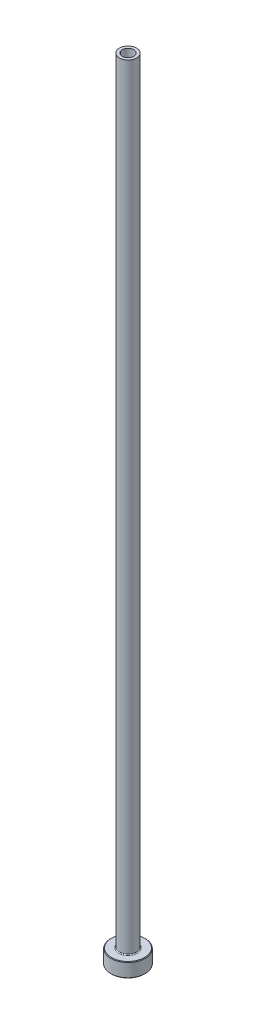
ISO-10303-21;
HEADER;
FILE_DESCRIPTION(('STEP AP214'),'2;1');
FILE_NAME('part.step','',(''),(''),'','','');
FILE_SCHEMA(('AUTOMOTIVE_DESIGN { 1 0 10303 214 1 1 1 1 }'));
ENDSEC;
DATA;
#1=APPLICATION_CONTEXT('core data for automotive mechanical design processes');
#2=APPLICATION_PROTOCOL_DEFINITION('international standard','automotive_design',2000,#1);
#3=PRODUCT_CONTEXT('',#1,'mechanical');
#4=PRODUCT('Part','Part','',(#3));
#5=PRODUCT_RELATED_PRODUCT_CATEGORY('part','',(#4));
#6=PRODUCT_DEFINITION_FORMATION('','',#4);
#7=PRODUCT_DEFINITION_CONTEXT('part definition',#1,'design');
#8=PRODUCT_DEFINITION('design','',#6,#7);
#9=PRODUCT_DEFINITION_SHAPE('','',#8);
#10=(LENGTH_UNIT() NAMED_UNIT(*) SI_UNIT(.MILLI.,.METRE.));
#11=(NAMED_UNIT(*) PLANE_ANGLE_UNIT() SI_UNIT($,.RADIAN.));
#12=(NAMED_UNIT(*) SI_UNIT($,.STERADIAN.) SOLID_ANGLE_UNIT());
#13=UNCERTAINTY_MEASURE_WITH_UNIT(LENGTH_MEASURE(1.E-05),#10,'distance_accuracy_value','');
#14=(GEOMETRIC_REPRESENTATION_CONTEXT(3) GLOBAL_UNCERTAINTY_ASSIGNED_CONTEXT((#13)) GLOBAL_UNIT_ASSIGNED_CONTEXT((#10,
#11,#12)) REPRESENTATION_CONTEXT('',''));
#15=CARTESIAN_POINT('',(0.,0.,0.));
#16=DIRECTION('',(0.,0.,1.));
#17=DIRECTION('',(1.,0.,0.));
#18=AXIS2_PLACEMENT_3D('',#15,#16,#17);
#19=CARTESIAN_POINT('',(0.,92.1876809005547,0.));
#20=DIRECTION('',(0.,1.,0.));
#21=DIRECTION('',(0.,0.,1.));
#22=AXIS2_PLACEMENT_3D('',#19,#20,#21);
#23=CYLINDRICAL_SURFACE('',#22,2.00000000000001);
#24=CARTESIAN_POINT('',(0.,275.,0.));
#25=DIRECTION('',(0.,1.,0.));
#26=DIRECTION('',(0.,0.,1.));
#27=AXIS2_PLACEMENT_3D('',#24,#25,#26);
#28=CIRCLE('',#27,2.00000000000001);
#29=CARTESIAN_POINT('',(0.,275.,2.00000000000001));
#30=VERTEX_POINT('',#29);
#31=EDGE_CURVE('E62',#30,#30,#28,.T.);
#32=ORIENTED_EDGE('',*,*,#31,.T.);
#33=EDGE_LOOP('',(#32));
#34=FACE_BOUND('',#33,.T.);
#35=CARTESIAN_POINT('',(0.,230.,0.));
#36=DIRECTION('',(0.,1.,0.));
#37=DIRECTION('',(0.,0.,1.));
#38=AXIS2_PLACEMENT_3D('',#35,#36,#37);
#39=CIRCLE('',#38,2.00000000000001);
#40=CARTESIAN_POINT('',(0.,230.,2.00000000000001));
#41=VERTEX_POINT('',#40);
#42=EDGE_CURVE('E71',#41,#41,#39,.T.);
#43=ORIENTED_EDGE('',*,*,#42,.F.);
#44=EDGE_LOOP('',(#43));
#45=FACE_BOUND('',#44,.T.);
#46=ADVANCED_FACE('F30',(#34,#45),#23,.F.);
#47=CARTESIAN_POINT('',(-2.00000000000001,275.,0.));
#48=DIRECTION('',(0.,1.,0.));
#49=DIRECTION('',(0.,0.,1.));
#50=AXIS2_PLACEMENT_3D('',#47,#48,#49);
#51=PLANE('',#50);
#52=CARTESIAN_POINT('',(0.,275.,0.));
#53=DIRECTION('',(0.,1.,0.));
#54=DIRECTION('',(0.,0.,1.));
#55=AXIS2_PLACEMENT_3D('',#52,#53,#54);
#56=CIRCLE('',#55,3.00000000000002);
#57=CARTESIAN_POINT('',(0.,275.,3.00000000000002));
#58=VERTEX_POINT('',#57);
#59=EDGE_CURVE('E65',#58,#58,#56,.T.);
#60=ORIENTED_EDGE('',*,*,#59,.T.);
#61=EDGE_LOOP('',(#60));
#62=FACE_BOUND('',#61,.T.);
#63=ORIENTED_EDGE('',*,*,#31,.F.);
#64=EDGE_LOOP('',(#63));
#65=FACE_BOUND('',#64,.T.);
#66=ADVANCED_FACE('F79',(#62,#65),#51,.T.);
#67=CARTESIAN_POINT('',(0.,92.1876809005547,0.));
#68=DIRECTION('',(0.,1.,0.));
#69=DIRECTION('',(0.,0.,1.));
#70=AXIS2_PLACEMENT_3D('',#67,#68,#69);
#71=CYLINDRICAL_SURFACE('',#70,3.00000000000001);
#72=CARTESIAN_POINT('',(0.,5.3,0.));
#73=DIRECTION('',(0.,1.,0.));
#74=DIRECTION('',(0.,0.,1.));
#75=AXIS2_PLACEMENT_3D('',#72,#73,#74);
#76=CIRCLE('',#75,3.00000000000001);
#77=CARTESIAN_POINT('',(0.,5.3,3.00000000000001));
#78=VERTEX_POINT('',#77);
#79=EDGE_CURVE('E59',#78,#78,#76,.T.);
#80=ORIENTED_EDGE('',*,*,#79,.T.);
#81=EDGE_LOOP('',(#80));
#82=FACE_BOUND('',#81,.T.);
#83=ORIENTED_EDGE('',*,*,#59,.F.);
#84=EDGE_LOOP('',(#83));
#85=FACE_BOUND('',#84,.T.);
#86=ADVANCED_FACE('F85',(#82,#85),#71,.T.);
#87=CARTESIAN_POINT('',(-2.99999999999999,5.,0.));
#88=DIRECTION('',(0.,1.,0.));
#89=DIRECTION('',(0.,0.,1.));
#90=AXIS2_PLACEMENT_3D('',#87,#88,#89);
#91=PLANE('',#90);
#92=CARTESIAN_POINT('',(0.,5.,0.));
#93=DIRECTION('',(0.,1.,0.));
#94=DIRECTION('',(0.,0.,1.));
#95=AXIS2_PLACEMENT_3D('',#92,#93,#94);
#96=CIRCLE('',#95,5.79999999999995);
#97=CARTESIAN_POINT('',(0.,5.,5.79999999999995));
#98=VERTEX_POINT('',#97);
#99=EDGE_CURVE('E53',#98,#98,#96,.T.);
#100=ORIENTED_EDGE('',*,*,#99,.T.);
#101=EDGE_LOOP('',(#100));
#102=FACE_BOUND('',#101,.T.);
#103=CARTESIAN_POINT('',(0.,5.,0.));
#104=DIRECTION('',(0.,1.,0.));
#105=DIRECTION('',(0.,0.,1.));
#106=AXIS2_PLACEMENT_3D('',#103,#104,#105);
#107=CIRCLE('',#106,3.30000000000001);
#108=CARTESIAN_POINT('',(0.,5.,3.30000000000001));
#109=VERTEX_POINT('',#108);
#110=EDGE_CURVE('E56',#109,#109,#107,.F.);
#111=ORIENTED_EDGE('',*,*,#110,.T.);
#112=EDGE_LOOP('',(#111));
#113=FACE_BOUND('',#112,.T.);
#114=ADVANCED_FACE('F111',(#102,#113),#91,.T.);
#115=CARTESIAN_POINT('',(0.,92.1876809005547,0.));
#116=DIRECTION('',(0.,1.,0.));
#117=DIRECTION('',(0.,0.,1.));
#118=AXIS2_PLACEMENT_3D('',#115,#116,#117);
#119=CYLINDRICAL_SURFACE('',#118,5.99999999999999);
#120=CARTESIAN_POINT('',(0.,4.79999999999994,0.));
#121=DIRECTION('',(0.,1.,0.));
#122=DIRECTION('',(0.,0.,1.));
#123=AXIS2_PLACEMENT_3D('',#120,#121,#122);
#124=CIRCLE('',#123,5.99999999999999);
#125=CARTESIAN_POINT('',(0.,4.79999999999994,5.99999999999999));
#126=VERTEX_POINT('',#125);
#127=EDGE_CURVE('E45',#126,#126,#124,.F.);
#128=ORIENTED_EDGE('',*,*,#127,.T.);
#129=EDGE_LOOP('',(#128));
#130=FACE_BOUND('',#129,.T.);
#131=CARTESIAN_POINT('',(0.,0.199999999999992,0.));
#132=DIRECTION('',(0.,-1.,0.));
#133=DIRECTION('',(0.,0.,-1.));
#134=AXIS2_PLACEMENT_3D('',#131,#132,#133);
#135=CIRCLE('',#134,5.99999999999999);
#136=CARTESIAN_POINT('',(0.,0.199999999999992,-5.99999999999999));
#137=VERTEX_POINT('',#136);
#138=EDGE_CURVE('E50',#137,#137,#135,.F.);
#139=ORIENTED_EDGE('',*,*,#138,.T.);
#140=EDGE_LOOP('',(#139));
#141=FACE_BOUND('',#140,.T.);
#142=ADVANCED_FACE('F108',(#130,#141),#119,.T.);
#143=CARTESIAN_POINT('',(-5.99999999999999,0.,0.));
#144=DIRECTION('',(0.,-1.,0.));
#145=DIRECTION('',(0.,0.,-1.));
#146=AXIS2_PLACEMENT_3D('',#143,#144,#145);
#147=PLANE('',#146);
#148=CARTESIAN_POINT('',(0.,0.,0.));
#149=DIRECTION('',(0.,-1.,0.));
#150=DIRECTION('',(0.,0.,-1.));
#151=AXIS2_PLACEMENT_3D('',#148,#149,#150);
#152=CIRCLE('',#151,2.75);
#153=CARTESIAN_POINT('',(0.,0.,-2.75));
#154=VERTEX_POINT('',#153);
#155=EDGE_CURVE('E37',#154,#154,#152,.F.);
#156=ORIENTED_EDGE('',*,*,#155,.T.);
#157=EDGE_LOOP('',(#156));
#158=FACE_BOUND('',#157,.T.);
#159=CARTESIAN_POINT('',(0.,0.,0.));
#160=DIRECTION('',(0.,-1.,0.));
#161=DIRECTION('',(0.,0.,-1.));
#162=AXIS2_PLACEMENT_3D('',#159,#160,#161);
#163=CIRCLE('',#162,5.79999999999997);
#164=CARTESIAN_POINT('',(0.,0.,-5.79999999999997));
#165=VERTEX_POINT('',#164);
#166=EDGE_CURVE('E41',#165,#165,#163,.T.);
#167=ORIENTED_EDGE('',*,*,#166,.T.);
#168=EDGE_LOOP('',(#167));
#169=FACE_BOUND('',#168,.T.);
#170=ADVANCED_FACE('F110',(#158,#169),#147,.T.);
#171=CARTESIAN_POINT('',(0.,92.1876809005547,0.));
#172=DIRECTION('',(0.,1.,0.));
#173=DIRECTION('',(0.,0.,1.));
#174=AXIS2_PLACEMENT_3D('',#171,#172,#173);
#175=CYLINDRICAL_SURFACE('',#174,2.25);
#176=CARTESIAN_POINT('',(0.,0.500000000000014,0.));
#177=DIRECTION('',(0.,-1.,0.));
#178=DIRECTION('',(0.,0.,-1.));
#179=AXIS2_PLACEMENT_3D('',#176,#177,#178);
#180=CIRCLE('',#179,2.25);
#181=CARTESIAN_POINT('',(0.,0.500000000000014,-2.25));
#182=VERTEX_POINT('',#181);
#183=EDGE_CURVE('E10',#182,#182,#180,.T.);
#184=ORIENTED_EDGE('',*,*,#183,.T.);
#185=EDGE_LOOP('',(#184));
#186=FACE_BOUND('',#185,.T.);
#187=CARTESIAN_POINT('',(0.,218.,0.));
#188=DIRECTION('',(0.,1.,0.));
#189=DIRECTION('',(0.,0.,1.));
#190=AXIS2_PLACEMENT_3D('',#187,#188,#189);
#191=CIRCLE('',#190,2.25000000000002);
#192=CARTESIAN_POINT('',(0.,218.,2.25000000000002));
#193=VERTEX_POINT('',#192);
#194=EDGE_CURVE('E68',#193,#193,#191,.T.);
#195=ORIENTED_EDGE('',*,*,#194,.T.);
#196=EDGE_LOOP('',(#195));
#197=FACE_BOUND('',#196,.T.);
#198=ADVANCED_FACE('F118',(#186,#197),#175,.F.);
#199=CARTESIAN_POINT('',(0.,218.,0.));
#200=DIRECTION('',(0.,-1.,0.));
#201=DIRECTION('',(0.,0.,-1.));
#202=AXIS2_PLACEMENT_3D('',#199,#200,#201);
#203=CONICAL_SURFACE('',#202,2.25000000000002,0.0208303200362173);
#204=ORIENTED_EDGE('',*,*,#42,.T.);
#205=EDGE_LOOP('',(#204));
#206=FACE_BOUND('',#205,.T.);
#207=ORIENTED_EDGE('',*,*,#194,.F.);
#208=EDGE_LOOP('',(#207));
#209=FACE_BOUND('',#208,.T.);
#210=ADVANCED_FACE('F75',(#206,#209),#203,.F.);
#211=CARTESIAN_POINT('',(0.,5.3,0.));
#212=DIRECTION('',(0.,1.,0.));
#213=DIRECTION('',(0.,0.,1.));
#214=AXIS2_PLACEMENT_3D('',#211,#212,#213);
#215=TOROIDAL_SURFACE('',#214,3.30000000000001,0.3);
#216=ORIENTED_EDGE('',*,*,#110,.F.);
#217=EDGE_LOOP('',(#216));
#218=FACE_BOUND('',#217,.T.);
#219=ORIENTED_EDGE('',*,*,#79,.F.);
#220=EDGE_LOOP('',(#219));
#221=FACE_BOUND('',#220,.T.);
#222=ADVANCED_FACE('F90',(#218,#221),#215,.F.);
#223=CARTESIAN_POINT('',(0.,5.,0.));
#224=DIRECTION('',(0.,-1.,0.));
#225=DIRECTION('',(0.,0.,-1.));
#226=AXIS2_PLACEMENT_3D('',#223,#224,#225);
#227=CONICAL_SURFACE('',#226,5.79999999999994,0.785398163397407);
#228=ORIENTED_EDGE('',*,*,#127,.F.);
#229=EDGE_LOOP('',(#228));
#230=FACE_BOUND('',#229,.T.);
#231=ORIENTED_EDGE('',*,*,#99,.F.);
#232=EDGE_LOOP('',(#231));
#233=FACE_BOUND('',#232,.T.);
#234=ADVANCED_FACE('F93',(#230,#233),#227,.T.);
#235=CARTESIAN_POINT('',(0.,0.199999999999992,0.));
#236=DIRECTION('',(0.,1.,0.));
#237=DIRECTION('',(0.,0.,1.));
#238=AXIS2_PLACEMENT_3D('',#235,#236,#237);
#239=CONICAL_SURFACE('',#238,5.99999999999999,0.785398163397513);
#240=ORIENTED_EDGE('',*,*,#166,.F.);
#241=EDGE_LOOP('',(#240));
#242=FACE_BOUND('',#241,.T.);
#243=ORIENTED_EDGE('',*,*,#138,.F.);
#244=EDGE_LOOP('',(#243));
#245=FACE_BOUND('',#244,.T.);
#246=ADVANCED_FACE('F96',(#242,#245),#239,.T.);
#247=CARTESIAN_POINT('',(0.,0.,0.));
#248=DIRECTION('',(0.,-1.,0.));
#249=DIRECTION('',(0.,0.,-1.));
#250=AXIS2_PLACEMENT_3D('',#247,#248,#249);
#251=CONICAL_SURFACE('',#250,2.75,0.785398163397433);
#252=ORIENTED_EDGE('',*,*,#183,.F.);
#253=EDGE_LOOP('',(#252));
#254=FACE_BOUND('',#253,.T.);
#255=ORIENTED_EDGE('',*,*,#155,.F.);
#256=EDGE_LOOP('',(#255));
#257=FACE_BOUND('',#256,.T.);
#258=ADVANCED_FACE('F32',(#254,#257),#251,.F.);
#259=CLOSED_SHELL('',(#46,#66,#86,#114,#142,#170,#198,#210,#222,#234,#246,#258));
#260=MANIFOLD_SOLID_BREP('B2',#259);
#261=ADVANCED_BREP_SHAPE_REPRESENTATION('',(#18,#260),#14);
#262=SHAPE_DEFINITION_REPRESENTATION(#9,#261);
ENDSEC;
END-ISO-10303-21;
